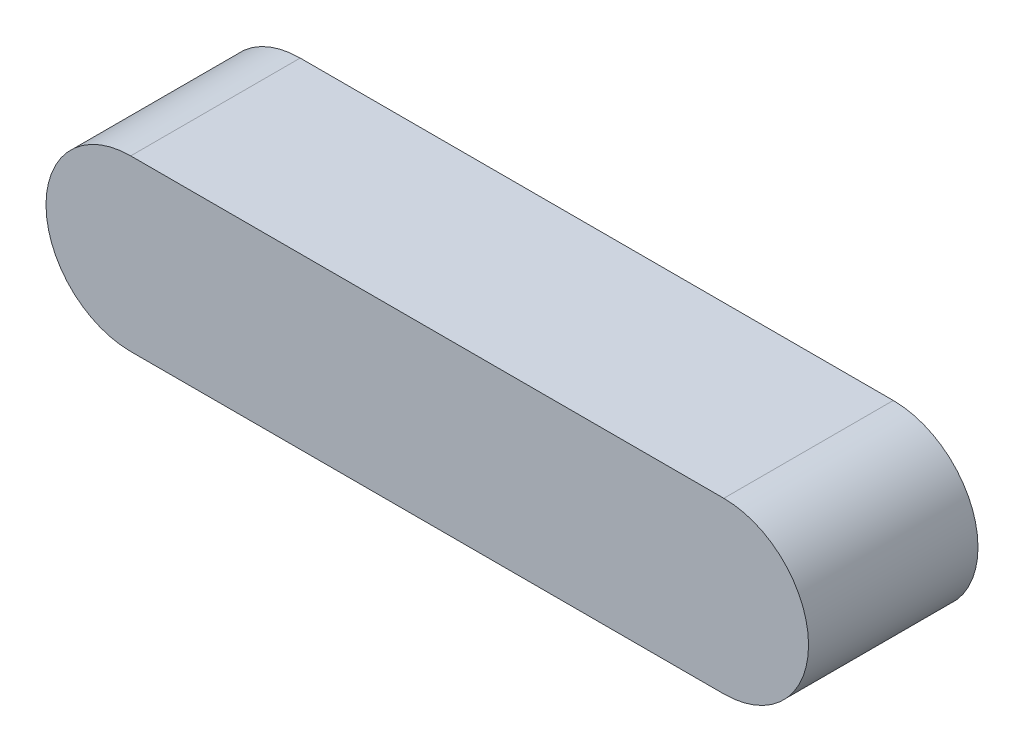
ISO-10303-21;
HEADER;
FILE_DESCRIPTION(('STEP AP214'),'2;1');
FILE_NAME('part.step','',(''),(''),'','','');
FILE_SCHEMA(('AUTOMOTIVE_DESIGN { 1 0 10303 214 1 1 1 1 }'));
ENDSEC;
DATA;
#1=APPLICATION_CONTEXT('core data for automotive mechanical design processes');
#2=APPLICATION_PROTOCOL_DEFINITION('international standard','automotive_design',2000,#1);
#3=PRODUCT_CONTEXT('',#1,'mechanical');
#4=PRODUCT('Part','Part','',(#3));
#5=PRODUCT_RELATED_PRODUCT_CATEGORY('part','',(#4));
#6=PRODUCT_DEFINITION_FORMATION('','',#4);
#7=PRODUCT_DEFINITION_CONTEXT('part definition',#1,'design');
#8=PRODUCT_DEFINITION('design','',#6,#7);
#9=PRODUCT_DEFINITION_SHAPE('','',#8);
#10=(LENGTH_UNIT() NAMED_UNIT(*) SI_UNIT(.MILLI.,.METRE.));
#11=(NAMED_UNIT(*) PLANE_ANGLE_UNIT() SI_UNIT($,.RADIAN.));
#12=(NAMED_UNIT(*) SI_UNIT($,.STERADIAN.) SOLID_ANGLE_UNIT());
#13=UNCERTAINTY_MEASURE_WITH_UNIT(LENGTH_MEASURE(1.E-05),#10,'distance_accuracy_value','');
#14=(GEOMETRIC_REPRESENTATION_CONTEXT(3) GLOBAL_UNCERTAINTY_ASSIGNED_CONTEXT((#13)) GLOBAL_UNIT_ASSIGNED_CONTEXT((#10,
#11,#12)) REPRESENTATION_CONTEXT('',''));
#15=CARTESIAN_POINT('',(0.,0.,0.));
#16=DIRECTION('',(0.,0.,1.));
#17=DIRECTION('',(1.,0.,0.));
#18=AXIS2_PLACEMENT_3D('',#15,#16,#17);
#19=CARTESIAN_POINT('',(2.60410580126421,1.21407625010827,8.));
#20=DIRECTION('',(0.,0.,1.));
#21=DIRECTION('',(1.,0.,0.));
#22=AXIS2_PLACEMENT_3D('',#19,#20,#21);
#23=PLANE('',#22);
#24=DIRECTION('',(1.,0.,0.));
#25=VECTOR('',#24,1.);
#26=CARTESIAN_POINT('',(16.6041058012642,-2.78592374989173,8.));
#27=LINE('',#26,#25);
#28=CARTESIAN_POINT('',(16.6041058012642,-2.78592374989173,8.));
#29=VERTEX_POINT('',#28);
#30=CARTESIAN_POINT('',(-11.3958941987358,-2.78592374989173,8.));
#31=VERTEX_POINT('',#30);
#32=EDGE_CURVE('E66',#29,#31,#27,.F.);
#33=ORIENTED_EDGE('',*,*,#32,.F.);
#34=CARTESIAN_POINT('',(16.6041058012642,1.21407625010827,8.));
#35=DIRECTION('',(0.,0.,1.));
#36=DIRECTION('',(1.,0.,0.));
#37=AXIS2_PLACEMENT_3D('',#34,#35,#36);
#38=CIRCLE('',#37,4.);
#39=CARTESIAN_POINT('',(16.6041058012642,5.21407625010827,8.));
#40=VERTEX_POINT('',#39);
#41=EDGE_CURVE('E20',#40,#29,#38,.F.);
#42=ORIENTED_EDGE('',*,*,#41,.F.);
#43=DIRECTION('',(1.,0.,0.));
#44=VECTOR('',#43,1.);
#45=CARTESIAN_POINT('',(-11.3958941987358,5.21407625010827,8.));
#46=LINE('',#45,#44);
#47=CARTESIAN_POINT('',(-11.3958941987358,5.21407625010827,8.));
#48=VERTEX_POINT('',#47);
#49=EDGE_CURVE('E53',#48,#40,#46,.T.);
#50=ORIENTED_EDGE('',*,*,#49,.F.);
#51=CARTESIAN_POINT('',(-11.3958941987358,1.21407625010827,8.));
#52=DIRECTION('',(0.,0.,1.));
#53=DIRECTION('',(1.,0.,0.));
#54=AXIS2_PLACEMENT_3D('',#51,#52,#53);
#55=CIRCLE('',#54,4.);
#56=EDGE_CURVE('E68',#31,#48,#55,.F.);
#57=ORIENTED_EDGE('',*,*,#56,.F.);
#58=EDGE_LOOP('',(#33,#42,#50,#57));
#59=FACE_BOUND('',#58,.T.);
#60=ADVANCED_FACE('F16',(#59),#23,.T.);
#61=CARTESIAN_POINT('',(16.6041058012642,-2.78592374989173,0.));
#62=DIRECTION('',(0.,-1.,0.));
#63=DIRECTION('',(0.,0.,-1.));
#64=AXIS2_PLACEMENT_3D('',#61,#62,#63);
#65=PLANE('',#64);
#66=DIRECTION('',(1.,0.,0.));
#67=VECTOR('',#66,1.);
#68=CARTESIAN_POINT('',(2.60410580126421,-2.78592374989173,0.));
#69=LINE('',#68,#67);
#70=CARTESIAN_POINT('',(-11.3958941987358,-2.78592374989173,0.));
#71=VERTEX_POINT('',#70);
#72=CARTESIAN_POINT('',(16.6041058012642,-2.78592374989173,0.));
#73=VERTEX_POINT('',#72);
#74=EDGE_CURVE('E75',#71,#73,#69,.T.);
#75=ORIENTED_EDGE('',*,*,#74,.T.);
#76=DIRECTION('',(0.,0.,1.));
#77=VECTOR('',#76,1.);
#78=CARTESIAN_POINT('',(16.6041058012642,-2.78592374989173,0.));
#79=LINE('',#78,#77);
#80=EDGE_CURVE('E62',#29,#73,#79,.F.);
#81=ORIENTED_EDGE('',*,*,#80,.F.);
#82=ORIENTED_EDGE('',*,*,#32,.T.);
#83=DIRECTION('',(0.,0.,1.));
#84=VECTOR('',#83,1.);
#85=CARTESIAN_POINT('',(-11.3958941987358,-2.78592374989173,0.));
#86=LINE('',#85,#84);
#87=EDGE_CURVE('E82',#71,#31,#86,.T.);
#88=ORIENTED_EDGE('',*,*,#87,.F.);
#89=EDGE_LOOP('',(#75,#81,#82,#88));
#90=FACE_BOUND('',#89,.T.);
#91=ADVANCED_FACE('F74',(#90),#65,.T.);
#92=CARTESIAN_POINT('',(16.6041058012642,1.21407625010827,0.));
#93=DIRECTION('',(0.,0.,1.));
#94=DIRECTION('',(1.,0.,0.));
#95=AXIS2_PLACEMENT_3D('',#92,#93,#94);
#96=CYLINDRICAL_SURFACE('',#95,4.);
#97=CARTESIAN_POINT('',(16.6041058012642,1.21407625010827,0.));
#98=DIRECTION('',(0.,0.,1.));
#99=DIRECTION('',(1.,0.,0.));
#100=AXIS2_PLACEMENT_3D('',#97,#98,#99);
#101=CIRCLE('',#100,4.);
#102=CARTESIAN_POINT('',(16.6041058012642,5.21407625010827,0.));
#103=VERTEX_POINT('',#102);
#104=EDGE_CURVE('E81',#73,#103,#101,.T.);
#105=ORIENTED_EDGE('',*,*,#104,.T.);
#106=DIRECTION('',(0.,0.,1.));
#107=VECTOR('',#106,1.);
#108=CARTESIAN_POINT('',(16.6041058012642,5.21407625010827,0.));
#109=LINE('',#108,#107);
#110=EDGE_CURVE('E64',#40,#103,#109,.F.);
#111=ORIENTED_EDGE('',*,*,#110,.F.);
#112=ORIENTED_EDGE('',*,*,#41,.T.);
#113=ORIENTED_EDGE('',*,*,#80,.T.);
#114=EDGE_LOOP('',(#105,#111,#112,#113));
#115=FACE_BOUND('',#114,.T.);
#116=ADVANCED_FACE('F60',(#115),#96,.T.);
#117=CARTESIAN_POINT('',(-11.3958941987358,5.21407625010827,0.));
#118=DIRECTION('',(0.,1.,0.));
#119=DIRECTION('',(0.,0.,1.));
#120=AXIS2_PLACEMENT_3D('',#117,#118,#119);
#121=PLANE('',#120);
#122=DIRECTION('',(1.,0.,0.));
#123=VECTOR('',#122,1.);
#124=CARTESIAN_POINT('',(2.60410580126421,5.21407625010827,0.));
#125=LINE('',#124,#123);
#126=CARTESIAN_POINT('',(-11.3958941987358,5.21407625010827,0.));
#127=VERTEX_POINT('',#126);
#128=EDGE_CURVE('E26',#103,#127,#125,.F.);
#129=ORIENTED_EDGE('',*,*,#128,.T.);
#130=DIRECTION('',(0.,0.,1.));
#131=VECTOR('',#130,1.);
#132=CARTESIAN_POINT('',(-11.3958941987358,5.21407625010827,0.));
#133=LINE('',#132,#131);
#134=EDGE_CURVE('E34',#48,#127,#133,.F.);
#135=ORIENTED_EDGE('',*,*,#134,.F.);
#136=ORIENTED_EDGE('',*,*,#49,.T.);
#137=ORIENTED_EDGE('',*,*,#110,.T.);
#138=EDGE_LOOP('',(#129,#135,#136,#137));
#139=FACE_BOUND('',#138,.T.);
#140=ADVANCED_FACE('F86',(#139),#121,.T.);
#141=CARTESIAN_POINT('',(-11.3958941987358,1.21407625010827,0.));
#142=DIRECTION('',(0.,0.,1.));
#143=DIRECTION('',(1.,0.,0.));
#144=AXIS2_PLACEMENT_3D('',#141,#142,#143);
#145=CYLINDRICAL_SURFACE('',#144,4.);
#146=CARTESIAN_POINT('',(-11.3958941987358,1.21407625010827,0.));
#147=DIRECTION('',(0.,0.,1.));
#148=DIRECTION('',(1.,0.,0.));
#149=AXIS2_PLACEMENT_3D('',#146,#147,#148);
#150=CIRCLE('',#149,4.);
#151=EDGE_CURVE('E10',#127,#71,#150,.T.);
#152=ORIENTED_EDGE('',*,*,#151,.T.);
#153=ORIENTED_EDGE('',*,*,#87,.T.);
#154=ORIENTED_EDGE('',*,*,#56,.T.);
#155=ORIENTED_EDGE('',*,*,#134,.T.);
#156=EDGE_LOOP('',(#152,#153,#154,#155));
#157=FACE_BOUND('',#156,.T.);
#158=ADVANCED_FACE('F90',(#157),#145,.T.);
#159=CARTESIAN_POINT('',(2.60410580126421,1.21407625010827,0.));
#160=DIRECTION('',(0.,0.,1.));
#161=DIRECTION('',(1.,0.,0.));
#162=AXIS2_PLACEMENT_3D('',#159,#160,#161);
#163=PLANE('',#162);
#164=ORIENTED_EDGE('',*,*,#128,.F.);
#165=ORIENTED_EDGE('',*,*,#104,.F.);
#166=ORIENTED_EDGE('',*,*,#74,.F.);
#167=ORIENTED_EDGE('',*,*,#151,.F.);
#168=EDGE_LOOP('',(#164,#165,#166,#167));
#169=FACE_BOUND('',#168,.T.);
#170=ADVANCED_FACE('F18',(#169),#163,.F.);
#171=CLOSED_SHELL('',(#60,#91,#116,#140,#158,#170));
#172=MANIFOLD_SOLID_BREP('B1',#171);
#173=ADVANCED_BREP_SHAPE_REPRESENTATION('',(#18,#172),#14);
#174=SHAPE_DEFINITION_REPRESENTATION(#9,#173);
ENDSEC;
END-ISO-10303-21;
